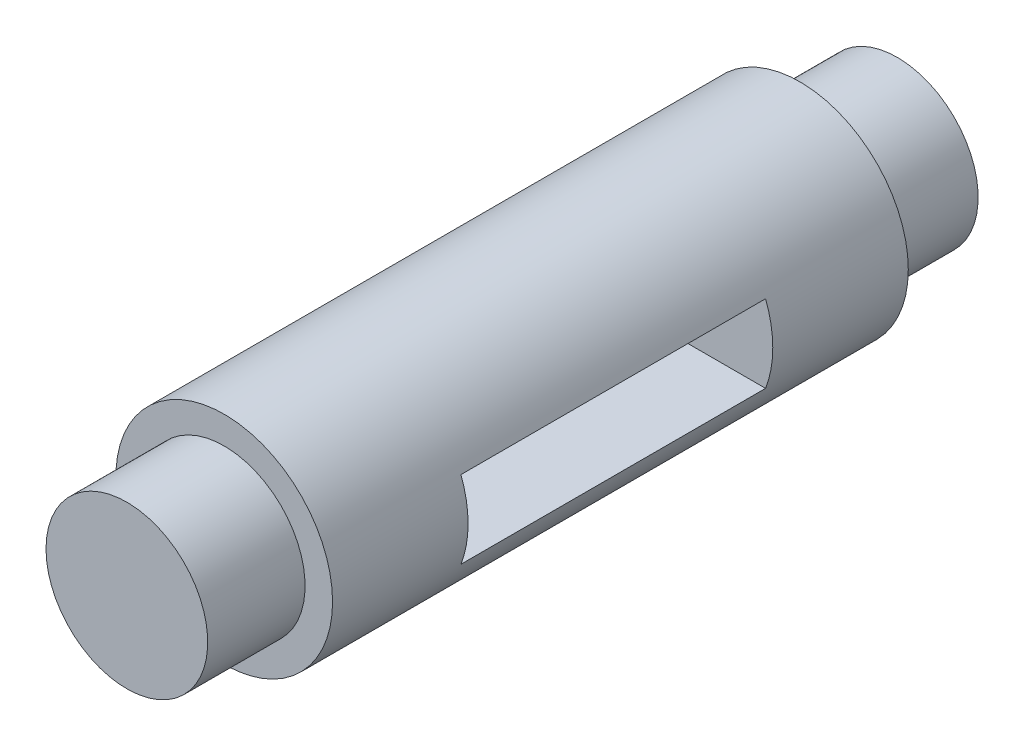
ISO-10303-21;
HEADER;
FILE_DESCRIPTION(('STEP AP214'),'2;1');
FILE_NAME('part.step','',(''),(''),'','','');
FILE_SCHEMA(('AUTOMOTIVE_DESIGN { 1 0 10303 214 1 1 1 1 }'));
ENDSEC;
DATA;
#1=APPLICATION_CONTEXT('core data for automotive mechanical design processes');
#2=APPLICATION_PROTOCOL_DEFINITION('international standard','automotive_design',2000,#1);
#3=PRODUCT_CONTEXT('',#1,'mechanical');
#4=PRODUCT('Part','Part','',(#3));
#5=PRODUCT_RELATED_PRODUCT_CATEGORY('part','',(#4));
#6=PRODUCT_DEFINITION_FORMATION('','',#4);
#7=PRODUCT_DEFINITION_CONTEXT('part definition',#1,'design');
#8=PRODUCT_DEFINITION('design','',#6,#7);
#9=PRODUCT_DEFINITION_SHAPE('','',#8);
#10=(LENGTH_UNIT() NAMED_UNIT(*) SI_UNIT(.MILLI.,.METRE.));
#11=(NAMED_UNIT(*) PLANE_ANGLE_UNIT() SI_UNIT($,.RADIAN.));
#12=(NAMED_UNIT(*) SI_UNIT($,.STERADIAN.) SOLID_ANGLE_UNIT());
#13=UNCERTAINTY_MEASURE_WITH_UNIT(LENGTH_MEASURE(1.E-05),#10,'distance_accuracy_value','');
#14=(GEOMETRIC_REPRESENTATION_CONTEXT(3) GLOBAL_UNCERTAINTY_ASSIGNED_CONTEXT((#13)) GLOBAL_UNIT_ASSIGNED_CONTEXT((#10,
#11,#12)) REPRESENTATION_CONTEXT('',''));
#15=CARTESIAN_POINT('',(0.,0.,0.));
#16=DIRECTION('',(0.,0.,1.));
#17=DIRECTION('',(1.,0.,0.));
#18=AXIS2_PLACEMENT_3D('',#15,#16,#17);
#19=CARTESIAN_POINT('',(0.,0.,11.303));
#20=DIRECTION('',(0.,0.,1.));
#21=DIRECTION('',(1.,0.,0.));
#22=AXIS2_PLACEMENT_3D('',#19,#20,#21);
#23=PLANE('',#22);
#24=CARTESIAN_POINT('',(0.,0.,11.303));
#25=DIRECTION('',(0.,0.,1.));
#26=DIRECTION('',(1.,0.,0.));
#27=AXIS2_PLACEMENT_3D('',#24,#25,#26);
#28=CIRCLE('',#27,4.2545);
#29=CARTESIAN_POINT('',(4.2545,0.,11.303));
#30=VERTEX_POINT('',#29);
#31=EDGE_CURVE('E99',#30,#30,#28,.T.);
#32=ORIENTED_EDGE('',*,*,#31,.T.);
#33=EDGE_LOOP('',(#32));
#34=FACE_BOUND('',#33,.T.);
#35=CARTESIAN_POINT('',(0.,0.,11.303));
#36=DIRECTION('',(0.,0.,1.));
#37=DIRECTION('',(1.,0.,0.));
#38=AXIS2_PLACEMENT_3D('',#35,#36,#37);
#39=CIRCLE('',#38,3.175);
#40=CARTESIAN_POINT('',(-3.175,0.,11.303));
#41=VERTEX_POINT('',#40);
#42=EDGE_CURVE('E104',#41,#41,#39,.T.);
#43=ORIENTED_EDGE('',*,*,#42,.F.);
#44=EDGE_LOOP('',(#43));
#45=FACE_BOUND('',#44,.T.);
#46=ADVANCED_FACE('F33',(#34,#45),#23,.T.);
#47=CARTESIAN_POINT('',(0.,0.,-11.303));
#48=DIRECTION('',(0.,0.,1.));
#49=DIRECTION('',(1.,0.,0.));
#50=AXIS2_PLACEMENT_3D('',#47,#48,#49);
#51=PLANE('',#50);
#52=CARTESIAN_POINT('',(0.,0.,-11.303));
#53=DIRECTION('',(0.,0.,1.));
#54=DIRECTION('',(1.,0.,0.));
#55=AXIS2_PLACEMENT_3D('',#52,#53,#54);
#56=CIRCLE('',#55,4.2545);
#57=CARTESIAN_POINT('',(4.2545,0.,-11.303));
#58=VERTEX_POINT('',#57);
#59=EDGE_CURVE('E101',#58,#58,#56,.T.);
#60=ORIENTED_EDGE('',*,*,#59,.F.);
#61=EDGE_LOOP('',(#60));
#62=FACE_BOUND('',#61,.T.);
#63=CARTESIAN_POINT('',(0.,0.,-11.303));
#64=DIRECTION('',(0.,0.,1.));
#65=DIRECTION('',(1.,0.,0.));
#66=AXIS2_PLACEMENT_3D('',#63,#64,#65);
#67=CIRCLE('',#66,3.175);
#68=CARTESIAN_POINT('',(-3.175,0.,-11.303));
#69=VERTEX_POINT('',#68);
#70=EDGE_CURVE('E109',#69,#69,#67,.F.);
#71=ORIENTED_EDGE('',*,*,#70,.F.);
#72=EDGE_LOOP('',(#71));
#73=FACE_BOUND('',#72,.T.);
#74=ADVANCED_FACE('F135',(#62,#73),#51,.F.);
#75=CARTESIAN_POINT('',(0.,0.,11.303));
#76=DIRECTION('',(0.,0.,-1.));
#77=DIRECTION('',(-1.,0.,0.));
#78=AXIS2_PLACEMENT_3D('',#75,#76,#77);
#79=CYLINDRICAL_SURFACE('',#78,4.2545);
#80=CARTESIAN_POINT('',(0.,0.,5.9817));
#81=DIRECTION('',(0.,0.,1.));
#82=DIRECTION('',(1.,0.,0.));
#83=AXIS2_PLACEMENT_3D('',#80,#81,#82);
#84=CIRCLE('',#83,4.2545);
#85=CARTESIAN_POINT('',(-3.97217751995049,1.524,5.9817));
#86=VERTEX_POINT('',#85);
#87=CARTESIAN_POINT('',(-3.97217751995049,-1.524,5.9817));
#88=VERTEX_POINT('',#87);
#89=EDGE_CURVE('E41',#86,#88,#84,.T.);
#90=ORIENTED_EDGE('',*,*,#89,.T.);
#91=DIRECTION('',(0.,0.,-1.));
#92=VECTOR('',#91,1.);
#93=CARTESIAN_POINT('',(-3.97217751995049,-1.524,11.303));
#94=LINE('',#93,#92);
#95=CARTESIAN_POINT('',(-3.97217751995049,-1.524,-5.9817));
#96=VERTEX_POINT('',#95);
#97=EDGE_CURVE('E11',#88,#96,#94,.T.);
#98=ORIENTED_EDGE('',*,*,#97,.T.);
#99=CARTESIAN_POINT('',(0.,0.,-5.9817));
#100=DIRECTION('',(0.,0.,1.));
#101=DIRECTION('',(1.,0.,0.));
#102=AXIS2_PLACEMENT_3D('',#99,#100,#101);
#103=CIRCLE('',#102,4.2545);
#104=CARTESIAN_POINT('',(-3.97217751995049,1.524,-5.9817));
#105=VERTEX_POINT('',#104);
#106=EDGE_CURVE('E71',#105,#96,#103,.T.);
#107=ORIENTED_EDGE('',*,*,#106,.F.);
#108=DIRECTION('',(0.,0.,-1.));
#109=VECTOR('',#108,1.);
#110=CARTESIAN_POINT('',(-3.97217751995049,1.524,11.303));
#111=LINE('',#110,#109);
#112=EDGE_CURVE('E75',#86,#105,#111,.T.);
#113=ORIENTED_EDGE('',*,*,#112,.F.);
#114=EDGE_LOOP('',(#90,#98,#107,#113));
#115=FACE_BOUND('',#114,.T.);
#116=CARTESIAN_POINT('',(3.97217751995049,-1.524,-5.9817));
#117=VERTEX_POINT('',#116);
#118=CARTESIAN_POINT('',(3.97217751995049,1.524,-5.9817));
#119=VERTEX_POINT('',#118);
#120=EDGE_CURVE('E78',#117,#119,#103,.T.);
#121=ORIENTED_EDGE('',*,*,#120,.F.);
#122=DIRECTION('',(0.,0.,-1.));
#123=VECTOR('',#122,1.);
#124=CARTESIAN_POINT('',(3.97217751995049,-1.524,11.303));
#125=LINE('',#124,#123);
#126=CARTESIAN_POINT('',(3.97217751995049,-1.524,5.9817));
#127=VERTEX_POINT('',#126);
#128=EDGE_CURVE('E76',#117,#127,#125,.F.);
#129=ORIENTED_EDGE('',*,*,#128,.T.);
#130=CARTESIAN_POINT('',(3.97217751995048,1.524,5.9817));
#131=VERTEX_POINT('',#130);
#132=EDGE_CURVE('E92',#127,#131,#84,.T.);
#133=ORIENTED_EDGE('',*,*,#132,.T.);
#134=DIRECTION('',(0.,0.,-1.));
#135=VECTOR('',#134,1.);
#136=CARTESIAN_POINT('',(3.97217751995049,1.524,11.303));
#137=LINE('',#136,#135);
#138=EDGE_CURVE('E96',#119,#131,#137,.F.);
#139=ORIENTED_EDGE('',*,*,#138,.F.);
#140=EDGE_LOOP('',(#121,#129,#133,#139));
#141=FACE_BOUND('',#140,.T.);
#142=ORIENTED_EDGE('',*,*,#31,.F.);
#143=EDGE_LOOP('',(#142));
#144=FACE_BOUND('',#143,.T.);
#145=ORIENTED_EDGE('',*,*,#59,.T.);
#146=EDGE_LOOP('',(#145));
#147=FACE_BOUND('',#146,.T.);
#148=ADVANCED_FACE('F35',(#115,#141,#144,#147),#79,.T.);
#149=CARTESIAN_POINT('',(0.,0.,-15.1257));
#150=DIRECTION('',(0.,0.,1.));
#151=DIRECTION('',(1.,0.,0.));
#152=AXIS2_PLACEMENT_3D('',#149,#150,#151);
#153=PLANE('',#152);
#154=CARTESIAN_POINT('',(0.,0.,-15.1257));
#155=DIRECTION('',(0.,0.,1.));
#156=DIRECTION('',(1.,0.,0.));
#157=AXIS2_PLACEMENT_3D('',#154,#155,#156);
#158=CIRCLE('',#157,3.175);
#159=CARTESIAN_POINT('',(-3.175,0.,-15.1257));
#160=VERTEX_POINT('',#159);
#161=EDGE_CURVE('E113',#160,#160,#158,.T.);
#162=ORIENTED_EDGE('',*,*,#161,.F.);
#163=EDGE_LOOP('',(#162));
#164=FACE_BOUND('',#163,.T.);
#165=ADVANCED_FACE('F149',(#164),#153,.F.);
#166=CARTESIAN_POINT('',(0.,0.,15.1257));
#167=DIRECTION('',(0.,0.,-1.));
#168=DIRECTION('',(-1.,0.,0.));
#169=AXIS2_PLACEMENT_3D('',#166,#167,#168);
#170=CYLINDRICAL_SURFACE('',#169,3.175);
#171=CARTESIAN_POINT('',(-3.175,0.,-15.1257));
#172=CARTESIAN_POINT('',(-3.175,0.,-15.0858802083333));
#173=CARTESIAN_POINT('',(-3.175,0.,-15.0460604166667));
#174=CARTESIAN_POINT('',(-3.175,0.,-14.9664208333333));
#175=CARTESIAN_POINT('',(-3.175,0.,-14.9266010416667));
#176=CARTESIAN_POINT('',(-3.175,0.,-14.8469614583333));
#177=CARTESIAN_POINT('',(-3.175,0.,-14.8071416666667));
#178=CARTESIAN_POINT('',(-3.175,0.,-14.7275020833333));
#179=CARTESIAN_POINT('',(-3.175,0.,-14.6876822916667));
#180=CARTESIAN_POINT('',(-3.175,0.,-14.6080427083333));
#181=CARTESIAN_POINT('',(-3.175,0.,-14.5682229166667));
#182=CARTESIAN_POINT('',(-3.175,0.,-14.4885833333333));
#183=CARTESIAN_POINT('',(-3.175,0.,-14.4487635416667));
#184=CARTESIAN_POINT('',(-3.175,0.,-14.3691239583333));
#185=CARTESIAN_POINT('',(-3.175,0.,-14.3293041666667));
#186=CARTESIAN_POINT('',(-3.175,0.,-14.2496645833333));
#187=CARTESIAN_POINT('',(-3.175,0.,-14.2098447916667));
#188=CARTESIAN_POINT('',(-3.175,0.,-14.1302052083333));
#189=CARTESIAN_POINT('',(-3.175,0.,-14.0903854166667));
#190=CARTESIAN_POINT('',(-3.175,0.,-14.0107458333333));
#191=CARTESIAN_POINT('',(-3.175,0.,-13.9709260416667));
#192=CARTESIAN_POINT('',(-3.175,0.,-13.8912864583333));
#193=CARTESIAN_POINT('',(-3.175,0.,-13.8514666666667));
#194=CARTESIAN_POINT('',(-3.175,0.,-13.7718270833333));
#195=CARTESIAN_POINT('',(-3.175,0.,-13.7320072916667));
#196=CARTESIAN_POINT('',(-3.175,0.,-13.6523677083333));
#197=CARTESIAN_POINT('',(-3.175,0.,-13.6125479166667));
#198=CARTESIAN_POINT('',(-3.175,0.,-13.5329083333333));
#199=CARTESIAN_POINT('',(-3.175,0.,-13.4930885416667));
#200=CARTESIAN_POINT('',(-3.175,0.,-13.4134489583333));
#201=CARTESIAN_POINT('',(-3.175,0.,-13.3736291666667));
#202=CARTESIAN_POINT('',(-3.175,0.,-13.2939895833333));
#203=CARTESIAN_POINT('',(-3.175,0.,-13.2541697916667));
#204=CARTESIAN_POINT('',(-3.175,0.,-13.1745302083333));
#205=CARTESIAN_POINT('',(-3.175,0.,-13.1347104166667));
#206=CARTESIAN_POINT('',(-3.175,0.,-13.0550708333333));
#207=CARTESIAN_POINT('',(-3.175,0.,-13.0152510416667));
#208=CARTESIAN_POINT('',(-3.175,0.,-12.9356114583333));
#209=CARTESIAN_POINT('',(-3.175,0.,-12.8957916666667));
#210=CARTESIAN_POINT('',(-3.175,0.,-12.8161520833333));
#211=CARTESIAN_POINT('',(-3.175,0.,-12.7763322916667));
#212=CARTESIAN_POINT('',(-3.175,0.,-12.6966927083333));
#213=CARTESIAN_POINT('',(-3.175,0.,-12.6568729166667));
#214=CARTESIAN_POINT('',(-3.175,0.,-12.5772333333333));
#215=CARTESIAN_POINT('',(-3.175,0.,-12.5374135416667));
#216=CARTESIAN_POINT('',(-3.175,0.,-12.4577739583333));
#217=CARTESIAN_POINT('',(-3.175,0.,-12.4179541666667));
#218=CARTESIAN_POINT('',(-3.175,0.,-12.3383145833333));
#219=CARTESIAN_POINT('',(-3.175,0.,-12.2984947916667));
#220=CARTESIAN_POINT('',(-3.175,0.,-12.2188552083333));
#221=CARTESIAN_POINT('',(-3.175,0.,-12.1790354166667));
#222=CARTESIAN_POINT('',(-3.175,0.,-12.0993958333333));
#223=CARTESIAN_POINT('',(-3.175,0.,-12.0595760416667));
#224=CARTESIAN_POINT('',(-3.175,0.,-11.9799364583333));
#225=CARTESIAN_POINT('',(-3.175,0.,-11.9401166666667));
#226=CARTESIAN_POINT('',(-3.175,0.,-11.8604770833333));
#227=CARTESIAN_POINT('',(-3.175,0.,-11.8206572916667));
#228=CARTESIAN_POINT('',(-3.175,0.,-11.7410177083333));
#229=CARTESIAN_POINT('',(-3.175,0.,-11.7011979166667));
#230=CARTESIAN_POINT('',(-3.175,0.,-11.6215583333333));
#231=CARTESIAN_POINT('',(-3.175,0.,-11.5817385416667));
#232=CARTESIAN_POINT('',(-3.175,0.,-11.5020989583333));
#233=CARTESIAN_POINT('',(-3.175,0.,-11.4622791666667));
#234=CARTESIAN_POINT('',(-3.175,0.,-11.3826395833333));
#235=CARTESIAN_POINT('',(-3.175,0.,-11.3428197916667));
#236=CARTESIAN_POINT('',(-3.175,0.,-11.303));
#237=B_SPLINE_CURVE_WITH_KNOTS('',3,(#171,#172,#173,#174,#175,#176,#177,#178,#179,#180,#181,
#182,#183,#184,#185,#186,#187,#188,#189,#190,#191,#192,#193,#194,#195,#196,#197,#198,#199,#200,
#201,#202,#203,#204,#205,#206,#207,#208,#209,#210,#211,#212,#213,#214,#215,#216,#217,#218,#219,
#220,#221,#222,#223,#224,#225,#226,#227,#228,#229,#230,#231,#232,#233,#234,#235,#236),
.UNSPECIFIED.,.F.,.F.,(4,2,2,2,2,2,2,2,2,2,2,2,2,2,2,2,2,2,2,2,2,2,2,2,2,2,2,2,2,2,2,2,4),(0.,
0.119459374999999,0.238918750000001,0.358378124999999,0.477837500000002,0.597296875,
0.716756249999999,0.836215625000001,0.955675,1.075134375,1.19459375,1.314053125,1.4335125,
1.552971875,1.67243125,1.791890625,1.91135,2.030809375,2.15026875,2.269728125,2.3891875,
2.508646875,2.62810625,2.747565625,2.867025,2.986484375,3.10594375,3.225403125,3.3448625,
3.464321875,3.58378125,3.703240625,3.8227),.UNSPECIFIED.);
#238=EDGE_CURVE('BSEAM147',#160,#69,#237,.T.);
#239=ORIENTED_EDGE('',*,*,#161,.T.);
#240=ORIENTED_EDGE('',*,*,#70,.T.);
#241=ORIENTED_EDGE('',*,*,#238,.T.);
#242=ORIENTED_EDGE('',*,*,#238,.F.);
#243=EDGE_LOOP('',(#239,#241,#240,#242));
#244=FACE_BOUND('',#243,.T.);
#245=ADVANCED_FACE('F147',(#244),#170,.T.);
#246=CARTESIAN_POINT('',(0.,0.,15.1257));
#247=DIRECTION('',(0.,0.,1.));
#248=DIRECTION('',(1.,0.,0.));
#249=AXIS2_PLACEMENT_3D('',#246,#247,#248);
#250=CIRCLE('',#249,3.175);
#251=CARTESIAN_POINT('',(-3.175,0.,15.1257));
#252=VERTEX_POINT('',#251);
#253=EDGE_CURVE('E112',#252,#252,#250,.T.);
#254=CARTESIAN_POINT('',(-3.175,0.,11.303));
#255=CARTESIAN_POINT('',(-3.175,0.,11.3428197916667));
#256=CARTESIAN_POINT('',(-3.175,0.,11.3826395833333));
#257=CARTESIAN_POINT('',(-3.175,0.,11.4622791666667));
#258=CARTESIAN_POINT('',(-3.175,0.,11.5020989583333));
#259=CARTESIAN_POINT('',(-3.175,0.,11.5817385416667));
#260=CARTESIAN_POINT('',(-3.175,0.,11.6215583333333));
#261=CARTESIAN_POINT('',(-3.175,0.,11.7011979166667));
#262=CARTESIAN_POINT('',(-3.175,0.,11.7410177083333));
#263=CARTESIAN_POINT('',(-3.175,0.,11.8206572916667));
#264=CARTESIAN_POINT('',(-3.175,0.,11.8604770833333));
#265=CARTESIAN_POINT('',(-3.175,0.,11.9401166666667));
#266=CARTESIAN_POINT('',(-3.175,0.,11.9799364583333));
#267=CARTESIAN_POINT('',(-3.175,0.,12.0595760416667));
#268=CARTESIAN_POINT('',(-3.175,0.,12.0993958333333));
#269=CARTESIAN_POINT('',(-3.175,0.,12.1790354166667));
#270=CARTESIAN_POINT('',(-3.175,0.,12.2188552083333));
#271=CARTESIAN_POINT('',(-3.175,0.,12.2984947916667));
#272=CARTESIAN_POINT('',(-3.175,0.,12.3383145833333));
#273=CARTESIAN_POINT('',(-3.175,0.,12.4179541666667));
#274=CARTESIAN_POINT('',(-3.175,0.,12.4577739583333));
#275=CARTESIAN_POINT('',(-3.175,0.,12.5374135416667));
#276=CARTESIAN_POINT('',(-3.175,0.,12.5772333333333));
#277=CARTESIAN_POINT('',(-3.175,0.,12.6568729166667));
#278=CARTESIAN_POINT('',(-3.175,0.,12.6966927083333));
#279=CARTESIAN_POINT('',(-3.175,0.,12.7763322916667));
#280=CARTESIAN_POINT('',(-3.175,0.,12.8161520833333));
#281=CARTESIAN_POINT('',(-3.175,0.,12.8957916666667));
#282=CARTESIAN_POINT('',(-3.175,0.,12.9356114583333));
#283=CARTESIAN_POINT('',(-3.175,0.,13.0152510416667));
#284=CARTESIAN_POINT('',(-3.175,0.,13.0550708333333));
#285=CARTESIAN_POINT('',(-3.175,0.,13.1347104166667));
#286=CARTESIAN_POINT('',(-3.175,0.,13.1745302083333));
#287=CARTESIAN_POINT('',(-3.175,0.,13.2541697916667));
#288=CARTESIAN_POINT('',(-3.175,0.,13.2939895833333));
#289=CARTESIAN_POINT('',(-3.175,0.,13.3736291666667));
#290=CARTESIAN_POINT('',(-3.175,0.,13.4134489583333));
#291=CARTESIAN_POINT('',(-3.175,0.,13.4930885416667));
#292=CARTESIAN_POINT('',(-3.175,0.,13.5329083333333));
#293=CARTESIAN_POINT('',(-3.175,0.,13.6125479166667));
#294=CARTESIAN_POINT('',(-3.175,0.,13.6523677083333));
#295=CARTESIAN_POINT('',(-3.175,0.,13.7320072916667));
#296=CARTESIAN_POINT('',(-3.175,0.,13.7718270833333));
#297=CARTESIAN_POINT('',(-3.175,0.,13.8514666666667));
#298=CARTESIAN_POINT('',(-3.175,0.,13.8912864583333));
#299=CARTESIAN_POINT('',(-3.175,0.,13.9709260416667));
#300=CARTESIAN_POINT('',(-3.175,0.,14.0107458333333));
#301=CARTESIAN_POINT('',(-3.175,0.,14.0903854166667));
#302=CARTESIAN_POINT('',(-3.175,0.,14.1302052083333));
#303=CARTESIAN_POINT('',(-3.175,0.,14.2098447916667));
#304=CARTESIAN_POINT('',(-3.175,0.,14.2496645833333));
#305=CARTESIAN_POINT('',(-3.175,0.,14.3293041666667));
#306=CARTESIAN_POINT('',(-3.175,0.,14.3691239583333));
#307=CARTESIAN_POINT('',(-3.175,0.,14.4487635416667));
#308=CARTESIAN_POINT('',(-3.175,0.,14.4885833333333));
#309=CARTESIAN_POINT('',(-3.175,0.,14.5682229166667));
#310=CARTESIAN_POINT('',(-3.175,0.,14.6080427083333));
#311=CARTESIAN_POINT('',(-3.175,0.,14.6876822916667));
#312=CARTESIAN_POINT('',(-3.175,0.,14.7275020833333));
#313=CARTESIAN_POINT('',(-3.175,0.,14.8071416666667));
#314=CARTESIAN_POINT('',(-3.175,0.,14.8469614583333));
#315=CARTESIAN_POINT('',(-3.175,0.,14.9266010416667));
#316=CARTESIAN_POINT('',(-3.175,0.,14.9664208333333));
#317=CARTESIAN_POINT('',(-3.175,0.,15.0460604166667));
#318=CARTESIAN_POINT('',(-3.175,0.,15.0858802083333));
#319=CARTESIAN_POINT('',(-3.175,0.,15.1257));
#320=B_SPLINE_CURVE_WITH_KNOTS('',3,(#254,#255,#256,#257,#258,#259,#260,#261,#262,#263,#264,
#265,#266,#267,#268,#269,#270,#271,#272,#273,#274,#275,#276,#277,#278,#279,#280,#281,#282,#283,
#284,#285,#286,#287,#288,#289,#290,#291,#292,#293,#294,#295,#296,#297,#298,#299,#300,#301,#302,
#303,#304,#305,#306,#307,#308,#309,#310,#311,#312,#313,#314,#315,#316,#317,#318,#319),
.UNSPECIFIED.,.F.,.F.,(4,2,2,2,2,2,2,2,2,2,2,2,2,2,2,2,2,2,2,2,2,2,2,2,2,2,2,2,2,2,2,2,4),(0.,
0.119459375,0.238918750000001,0.358378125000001,0.4778375,0.597296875,0.716756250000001,
0.836215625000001,0.955675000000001,1.075134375,1.19459375,1.314053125,1.4335125,1.552971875,
1.67243125,1.791890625,1.91135,2.030809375,2.15026875,2.269728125,2.3891875,2.508646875,
2.62810625,2.747565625,2.867025,2.986484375,3.10594375,3.225403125,3.3448625,3.464321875,
3.58378125,3.703240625,3.8227),.UNSPECIFIED.);
#321=EDGE_CURVE('BSEAM144',#41,#252,#320,.T.);
#322=ORIENTED_EDGE('',*,*,#42,.T.);
#323=ORIENTED_EDGE('',*,*,#253,.F.);
#324=ORIENTED_EDGE('',*,*,#321,.T.);
#325=ORIENTED_EDGE('',*,*,#321,.F.);
#326=EDGE_LOOP('',(#322,#324,#323,#325));
#327=FACE_BOUND('',#326,.T.);
#328=ADVANCED_FACE('F144',(#327),#170,.T.);
#329=CARTESIAN_POINT('',(0.,0.,15.1257));
#330=DIRECTION('',(0.,0.,1.));
#331=DIRECTION('',(1.,0.,0.));
#332=AXIS2_PLACEMENT_3D('',#329,#330,#331);
#333=PLANE('',#332);
#334=ORIENTED_EDGE('',*,*,#253,.T.);
#335=EDGE_LOOP('',(#334));
#336=FACE_BOUND('',#335,.T.);
#337=ADVANCED_FACE('F132',(#336),#333,.T.);
#338=CARTESIAN_POINT('',(-15.1257,-1.524,0.));
#339=DIRECTION('',(0.,-1.,0.));
#340=DIRECTION('',(0.,0.,-1.));
#341=AXIS2_PLACEMENT_3D('',#338,#339,#340);
#342=PLANE('',#341);
#343=DIRECTION('',(1.,0.,0.));
#344=VECTOR('',#343,1.);
#345=CARTESIAN_POINT('',(-15.1257,-1.524,5.9817));
#346=LINE('',#345,#344);
#347=EDGE_CURVE('E116',#88,#127,#346,.T.);
#348=ORIENTED_EDGE('',*,*,#347,.T.);
#349=ORIENTED_EDGE('',*,*,#128,.F.);
#350=DIRECTION('',(1.,0.,0.));
#351=VECTOR('',#350,1.);
#352=CARTESIAN_POINT('',(-15.1257,-1.524,-5.9817));
#353=LINE('',#352,#351);
#354=EDGE_CURVE('E53',#96,#117,#353,.T.);
#355=ORIENTED_EDGE('',*,*,#354,.F.);
#356=ORIENTED_EDGE('',*,*,#97,.F.);
#357=EDGE_LOOP('',(#348,#349,#355,#356));
#358=FACE_BOUND('',#357,.T.);
#359=ADVANCED_FACE('F81',(#358),#342,.F.);
#360=CARTESIAN_POINT('',(-15.1257,0.,5.9817));
#361=DIRECTION('',(0.,0.,1.));
#362=DIRECTION('',(1.,0.,0.));
#363=AXIS2_PLACEMENT_3D('',#360,#361,#362);
#364=PLANE('',#363);
#365=DIRECTION('',(1.,0.,0.));
#366=VECTOR('',#365,1.);
#367=CARTESIAN_POINT('',(-15.1257,1.524,5.9817));
#368=LINE('',#367,#366);
#369=EDGE_CURVE('E120',#86,#131,#368,.T.);
#370=ORIENTED_EDGE('',*,*,#369,.T.);
#371=ORIENTED_EDGE('',*,*,#132,.F.);
#372=ORIENTED_EDGE('',*,*,#347,.F.);
#373=ORIENTED_EDGE('',*,*,#89,.F.);
#374=EDGE_LOOP('',(#370,#371,#372,#373));
#375=FACE_BOUND('',#374,.T.);
#376=ADVANCED_FACE('F124',(#375),#364,.F.);
#377=CARTESIAN_POINT('',(-15.1257,1.524,0.));
#378=DIRECTION('',(0.,-1.,0.));
#379=DIRECTION('',(0.,0.,-1.));
#380=AXIS2_PLACEMENT_3D('',#377,#378,#379);
#381=PLANE('',#380);
#382=ORIENTED_EDGE('',*,*,#112,.T.);
#383=DIRECTION('',(1.,0.,0.));
#384=VECTOR('',#383,1.);
#385=CARTESIAN_POINT('',(-15.1257,1.524,-5.9817));
#386=LINE('',#385,#384);
#387=EDGE_CURVE('E48',#105,#119,#386,.T.);
#388=ORIENTED_EDGE('',*,*,#387,.T.);
#389=ORIENTED_EDGE('',*,*,#138,.T.);
#390=ORIENTED_EDGE('',*,*,#369,.F.);
#391=EDGE_LOOP('',(#382,#388,#389,#390));
#392=FACE_BOUND('',#391,.T.);
#393=ADVANCED_FACE('F123',(#392),#381,.T.);
#394=CARTESIAN_POINT('',(-15.1257,0.,-5.9817));
#395=DIRECTION('',(0.,0.,1.));
#396=DIRECTION('',(1.,0.,0.));
#397=AXIS2_PLACEMENT_3D('',#394,#395,#396);
#398=PLANE('',#397);
#399=ORIENTED_EDGE('',*,*,#106,.T.);
#400=ORIENTED_EDGE('',*,*,#354,.T.);
#401=ORIENTED_EDGE('',*,*,#120,.T.);
#402=ORIENTED_EDGE('',*,*,#387,.F.);
#403=EDGE_LOOP('',(#399,#400,#401,#402));
#404=FACE_BOUND('',#403,.T.);
#405=ADVANCED_FACE('F72',(#404),#398,.T.);
#406=CLOSED_SHELL('',(#46,#74,#148,#165,#245,#328,#337,#359,#376,#393,#405));
#407=MANIFOLD_SOLID_BREP('B2',#406);
#408=ADVANCED_BREP_SHAPE_REPRESENTATION('',(#18,#407),#14);
#409=SHAPE_DEFINITION_REPRESENTATION(#9,#408);
ENDSEC;
END-ISO-10303-21;
